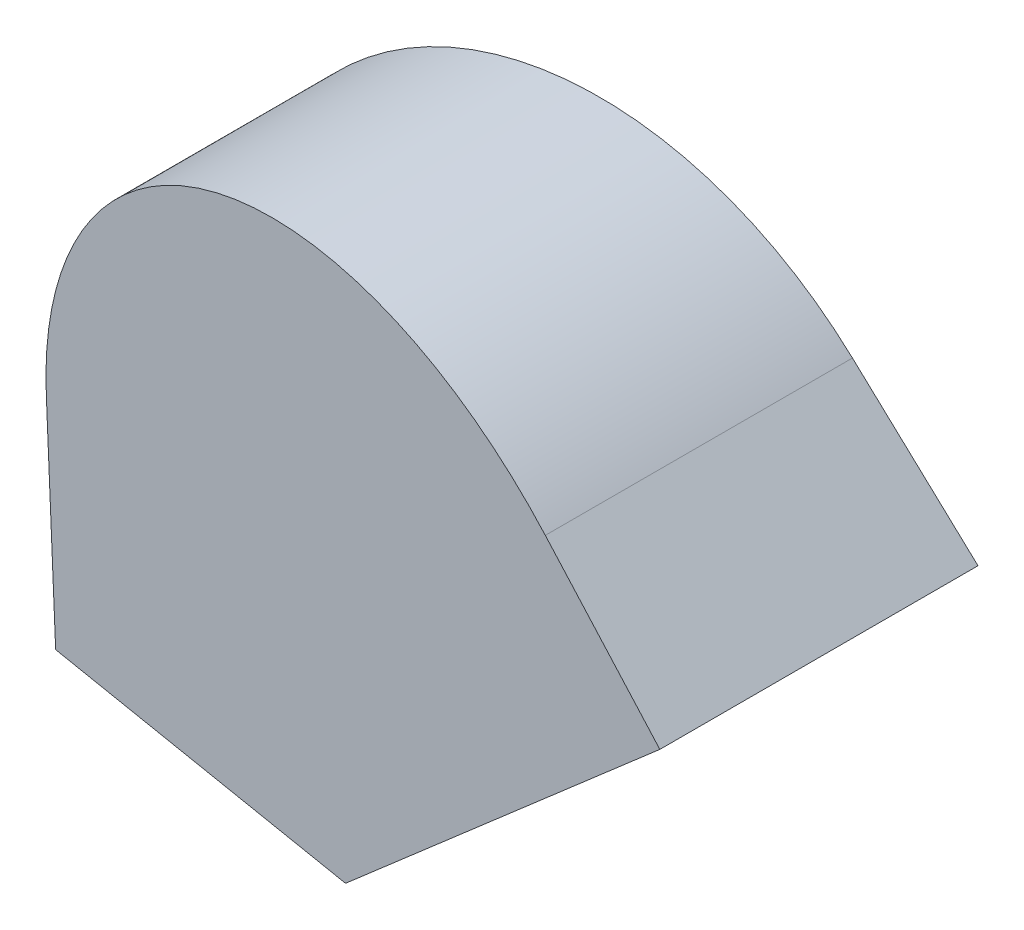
ISO-10303-21;
HEADER;
FILE_DESCRIPTION(('STEP AP214'),'2;1');
FILE_NAME('part.step','',(''),(''),'','','');
FILE_SCHEMA(('AUTOMOTIVE_DESIGN { 1 0 10303 214 1 1 1 1 }'));
ENDSEC;
DATA;
#1=APPLICATION_CONTEXT('core data for automotive mechanical design processes');
#2=APPLICATION_PROTOCOL_DEFINITION('international standard','automotive_design',2000,#1);
#3=PRODUCT_CONTEXT('',#1,'mechanical');
#4=PRODUCT('Part','Part','',(#3));
#5=PRODUCT_RELATED_PRODUCT_CATEGORY('part','',(#4));
#6=PRODUCT_DEFINITION_FORMATION('','',#4);
#7=PRODUCT_DEFINITION_CONTEXT('part definition',#1,'design');
#8=PRODUCT_DEFINITION('design','',#6,#7);
#9=PRODUCT_DEFINITION_SHAPE('','',#8);
#10=(LENGTH_UNIT() NAMED_UNIT(*) SI_UNIT(.MILLI.,.METRE.));
#11=(NAMED_UNIT(*) PLANE_ANGLE_UNIT() SI_UNIT($,.RADIAN.));
#12=(NAMED_UNIT(*) SI_UNIT($,.STERADIAN.) SOLID_ANGLE_UNIT());
#13=UNCERTAINTY_MEASURE_WITH_UNIT(LENGTH_MEASURE(1.E-05),#10,'distance_accuracy_value','');
#14=(GEOMETRIC_REPRESENTATION_CONTEXT(3) GLOBAL_UNCERTAINTY_ASSIGNED_CONTEXT((#13)) GLOBAL_UNIT_ASSIGNED_CONTEXT((#10,
#11,#12)) REPRESENTATION_CONTEXT('',''));
#15=CARTESIAN_POINT('',(0.,0.,0.));
#16=DIRECTION('',(0.,0.,1.));
#17=DIRECTION('',(1.,0.,0.));
#18=AXIS2_PLACEMENT_3D('',#15,#16,#17);
#19=CARTESIAN_POINT('',(-36.5,0.,128.145100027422));
#20=DIRECTION('',(0.998629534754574,-0.0523359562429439,0.));
#21=DIRECTION('',(0.0523359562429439,0.998629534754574,0.));
#22=AXIS2_PLACEMENT_3D('',#19,#20,#21);
#23=PLANE('',#22);
#24=DIRECTION('',(-0.0521179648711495,-0.994470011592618,-0.0911762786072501));
#25=VECTOR('',#24,1.);
#26=CARTESIAN_POINT('',(-35.9716780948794,10.080982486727,17.8886826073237));
#27=LINE('',#26,#25);
#28=CARTESIAN_POINT('',(-35.189805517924,25.,19.256507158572));
#29=VERTEX_POINT('',#28);
#30=CARTESIAN_POINT('',(-36.5,0.,16.9644250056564));
#31=VERTEX_POINT('',#30);
#32=EDGE_CURVE('E101',#29,#31,#27,.T.);
#33=ORIENTED_EDGE('',*,*,#32,.F.);
#34=DIRECTION('',(0.,0.,-1.));
#35=VECTOR('',#34,1.);
#36=CARTESIAN_POINT('',(-35.189805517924,25.,128.145100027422));
#37=LINE('',#36,#35);
#38=CARTESIAN_POINT('',(-35.189805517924,25.,0.));
#39=VERTEX_POINT('',#38);
#40=EDGE_CURVE('E36',#29,#39,#37,.T.);
#41=ORIENTED_EDGE('',*,*,#40,.T.);
#42=DIRECTION('',(-0.0523359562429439,-0.998629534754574,0.));
#43=VECTOR('',#42,1.);
#44=CARTESIAN_POINT('',(-36.5,0.,0.));
#45=LINE('',#44,#43);
#46=CARTESIAN_POINT('',(-36.5,0.,0.));
#47=VERTEX_POINT('',#46);
#48=EDGE_CURVE('E111',#39,#47,#45,.T.);
#49=ORIENTED_EDGE('',*,*,#48,.T.);
#50=DIRECTION('',(0.,0.,-1.));
#51=VECTOR('',#50,1.);
#52=CARTESIAN_POINT('',(-36.5,0.,128.145100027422));
#53=LINE('',#52,#51);
#54=EDGE_CURVE('E75',#31,#47,#53,.T.);
#55=ORIENTED_EDGE('',*,*,#54,.F.);
#56=EDGE_LOOP('',(#33,#41,#49,#55));
#57=FACE_BOUND('',#56,.T.);
#58=ADVANCED_FACE('F32',(#57),#23,.F.);
#59=CARTESIAN_POINT('',(-36.5,0.,128.145100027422));
#60=DIRECTION('',(0.,1.,0.));
#61=DIRECTION('',(0.,0.,1.));
#62=AXIS2_PLACEMENT_3D('',#59,#60,#61);
#63=PLANE('',#62);
#64=DIRECTION('',(0.986602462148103,0.,0.163142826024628));
#65=VECTOR('',#64,1.);
#66=CARTESIAN_POINT('',(-18.6046794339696,0.,19.9235633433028));
#67=LINE('',#66,#65);
#68=CARTESIAN_POINT('',(0.,0.,23.));
#69=VERTEX_POINT('',#68);
#70=EDGE_CURVE('E82',#31,#69,#67,.T.);
#71=ORIENTED_EDGE('',*,*,#70,.F.);
#72=ORIENTED_EDGE('',*,*,#54,.T.);
#73=DIRECTION('',(1.,0.,0.));
#74=VECTOR('',#73,1.);
#75=CARTESIAN_POINT('',(-36.5,0.,0.));
#76=LINE('',#75,#74);
#77=CARTESIAN_POINT('',(0.,0.,0.));
#78=VERTEX_POINT('',#77);
#79=EDGE_CURVE('E110',#47,#78,#76,.T.);
#80=ORIENTED_EDGE('',*,*,#79,.T.);
#81=DIRECTION('',(0.,0.,-1.));
#82=VECTOR('',#81,1.);
#83=CARTESIAN_POINT('',(0.,0.,128.145100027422));
#84=LINE('',#83,#82);
#85=EDGE_CURVE('E112',#69,#78,#84,.T.);
#86=ORIENTED_EDGE('',*,*,#85,.F.);
#87=EDGE_LOOP('',(#71,#72,#80,#86));
#88=FACE_BOUND('',#87,.T.);
#89=ADVANCED_FACE('F124',(#88),#63,.F.);
#90=CARTESIAN_POINT('',(0.,0.,128.145100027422));
#91=DIRECTION('',(-0.669130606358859,0.743144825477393,0.));
#92=DIRECTION('',(-0.743144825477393,-0.669130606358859,0.));
#93=AXIS2_PLACEMENT_3D('',#90,#91,#92);
#94=PLANE('',#93);
#95=DIRECTION('',(0.731589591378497,0.658726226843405,0.17565997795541));
#96=VECTOR('',#95,1.);
#97=CARTESIAN_POINT('',(13.512303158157,12.166532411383,26.2444021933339));
#98=LINE('',#97,#96);
#99=CARTESIAN_POINT('',(43.4739722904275,39.1441404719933,33.4384167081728));
#100=VERTEX_POINT('',#99);
#101=EDGE_CURVE('E41',#69,#100,#98,.T.);
#102=ORIENTED_EDGE('',*,*,#101,.F.);
#103=ORIENTED_EDGE('',*,*,#85,.T.);
#104=DIRECTION('',(0.743144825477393,0.669130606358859,0.));
#105=VECTOR('',#104,1.);
#106=CARTESIAN_POINT('',(0.,0.,0.));
#107=LINE('',#106,#105);
#108=CARTESIAN_POINT('',(43.4739722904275,39.1441404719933,0.));
#109=VERTEX_POINT('',#108);
#110=EDGE_CURVE('E95',#78,#109,#107,.T.);
#111=ORIENTED_EDGE('',*,*,#110,.T.);
#112=DIRECTION('',(0.,0.,-1.));
#113=VECTOR('',#112,1.);
#114=CARTESIAN_POINT('',(43.4739722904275,39.1441404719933,128.145100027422));
#115=LINE('',#114,#113);
#116=EDGE_CURVE('E87',#100,#109,#115,.T.);
#117=ORIENTED_EDGE('',*,*,#116,.F.);
#118=EDGE_LOOP('',(#102,#103,#111,#117));
#119=FACE_BOUND('',#118,.T.);
#120=ADVANCED_FACE('F93',(#119),#94,.F.);
#121=CARTESIAN_POINT('',(43.4739722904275,39.1441404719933,128.145100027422));
#122=DIRECTION('',(-0.681998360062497,-0.731353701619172,0.));
#123=DIRECTION('',(0.731353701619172,-0.681998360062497,0.));
#124=AXIS2_PLACEMENT_3D('',#121,#122,#123);
#125=PLANE('',#124);
#126=DIRECTION('',(-0.729845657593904,0.680592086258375,-0.0641851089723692));
#127=VECTOR('',#126,1.);
#128=CARTESIAN_POINT('',(47.910527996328,35.006985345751,33.828582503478));
#129=LINE('',#128,#127);
#130=CARTESIAN_POINT('',(30.2771570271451,51.4503697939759,32.2778438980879));
#131=VERTEX_POINT('',#130);
#132=EDGE_CURVE('E11',#100,#131,#129,.T.);
#133=ORIENTED_EDGE('',*,*,#132,.F.);
#134=ORIENTED_EDGE('',*,*,#116,.T.);
#135=DIRECTION('',(-0.731353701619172,0.681998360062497,0.));
#136=VECTOR('',#135,1.);
#137=CARTESIAN_POINT('',(43.4739722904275,39.1441404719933,0.));
#138=LINE('',#137,#136);
#139=CARTESIAN_POINT('',(30.2771570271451,51.4503697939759,0.));
#140=VERTEX_POINT('',#139);
#141=EDGE_CURVE('E97',#109,#140,#138,.T.);
#142=ORIENTED_EDGE('',*,*,#141,.T.);
#143=DIRECTION('',(0.,0.,-1.));
#144=VECTOR('',#143,1.);
#145=CARTESIAN_POINT('',(30.2771570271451,51.4503697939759,128.145100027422));
#146=LINE('',#145,#144);
#147=EDGE_CURVE('E54',#131,#140,#146,.T.);
#148=ORIENTED_EDGE('',*,*,#147,.F.);
#149=EDGE_LOOP('',(#133,#134,#142,#148));
#150=FACE_BOUND('',#149,.T.);
#151=ADVANCED_FACE('F86',(#150),#125,.F.);
#152=CARTESIAN_POINT('',(3.71068075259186,22.9613119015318,128.145100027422));
#153=DIRECTION('',(0.,0.,-1.));
#154=DIRECTION('',(-1.,0.,0.));
#155=AXIS2_PLACEMENT_3D('',#152,#153,#154);
#156=CYLINDRICAL_SURFACE('',#155,38.9538711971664);
#157=CARTESIAN_POINT('',(3.71068075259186,22.9613119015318,25.5197760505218));
#158=DIRECTION('',(-0.162598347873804,-0.0816316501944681,0.983309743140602));
#159=DIRECTION('',(-0.878779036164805,-0.441186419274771,-0.181939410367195));
#160=AXIS2_PLACEMENT_3D('',#157,#158,#159);
#161=ELLIPSE('',#160,39.6150566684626,38.9538711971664);
#162=EDGE_CURVE('E106',#131,#29,#161,.T.);
#163=ORIENTED_EDGE('',*,*,#162,.F.);
#164=ORIENTED_EDGE('',*,*,#147,.T.);
#165=CARTESIAN_POINT('',(3.71068075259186,22.9613119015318,0.));
#166=DIRECTION('',(0.,0.,1.));
#167=DIRECTION('',(-1.,0.,0.));
#168=AXIS2_PLACEMENT_3D('',#165,#166,#167);
#169=CIRCLE('',#168,38.9538711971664);
#170=EDGE_CURVE('E108',#140,#39,#169,.T.);
#171=ORIENTED_EDGE('',*,*,#170,.T.);
#172=ORIENTED_EDGE('',*,*,#40,.F.);
#173=EDGE_LOOP('',(#163,#164,#171,#172));
#174=FACE_BOUND('',#173,.T.);
#175=ADVANCED_FACE('F121',(#174),#156,.T.);
#176=CARTESIAN_POINT('',(3.71068075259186,22.9613119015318,0.));
#177=DIRECTION('',(0.,0.,-1.));
#178=DIRECTION('',(-1.,0.,0.));
#179=AXIS2_PLACEMENT_3D('',#176,#177,#178);
#180=PLANE('',#179);
#181=ORIENTED_EDGE('',*,*,#48,.F.);
#182=ORIENTED_EDGE('',*,*,#170,.F.);
#183=ORIENTED_EDGE('',*,*,#141,.F.);
#184=ORIENTED_EDGE('',*,*,#110,.F.);
#185=ORIENTED_EDGE('',*,*,#79,.F.);
#186=EDGE_LOOP('',(#181,#182,#183,#184,#185));
#187=FACE_BOUND('',#186,.T.);
#188=ADVANCED_FACE('F123',(#187),#180,.T.);
#189=CARTESIAN_POINT('',(-3.67734441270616,-1.84619153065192,22.2386551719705));
#190=DIRECTION('',(-0.162598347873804,-0.0816316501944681,0.983309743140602));
#191=DIRECTION('',(0.986602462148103,0.,0.163142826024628));
#192=AXIS2_PLACEMENT_3D('',#189,#190,#191);
#193=PLANE('',#192);
#194=ORIENTED_EDGE('',*,*,#162,.T.);
#195=ORIENTED_EDGE('',*,*,#32,.T.);
#196=ORIENTED_EDGE('',*,*,#70,.T.);
#197=ORIENTED_EDGE('',*,*,#101,.T.);
#198=ORIENTED_EDGE('',*,*,#132,.T.);
#199=EDGE_LOOP('',(#194,#195,#196,#197,#198));
#200=FACE_BOUND('',#199,.T.);
#201=ADVANCED_FACE('F34',(#200),#193,.T.);
#202=CLOSED_SHELL('',(#58,#89,#120,#151,#175,#188,#201));
#203=MANIFOLD_SOLID_BREP('B2',#202);
#204=ADVANCED_BREP_SHAPE_REPRESENTATION('',(#18,#203),#14);
#205=SHAPE_DEFINITION_REPRESENTATION(#9,#204);
ENDSEC;
END-ISO-10303-21;
